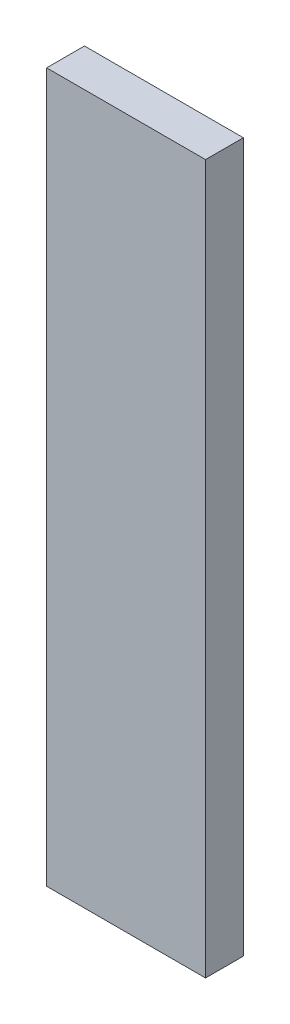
ISO-10303-21;
HEADER;
FILE_DESCRIPTION(('STEP AP214'),'2;1');
FILE_NAME('part.step','',(''),(''),'','','');
FILE_SCHEMA(('AUTOMOTIVE_DESIGN { 1 0 10303 214 1 1 1 1 }'));
ENDSEC;
DATA;
#1=APPLICATION_CONTEXT('core data for automotive mechanical design processes');
#2=APPLICATION_PROTOCOL_DEFINITION('international standard','automotive_design',2000,#1);
#3=PRODUCT_CONTEXT('',#1,'mechanical');
#4=PRODUCT('Part','Part','',(#3));
#5=PRODUCT_RELATED_PRODUCT_CATEGORY('part','',(#4));
#6=PRODUCT_DEFINITION_FORMATION('','',#4);
#7=PRODUCT_DEFINITION_CONTEXT('part definition',#1,'design');
#8=PRODUCT_DEFINITION('design','',#6,#7);
#9=PRODUCT_DEFINITION_SHAPE('','',#8);
#10=(LENGTH_UNIT() NAMED_UNIT(*) SI_UNIT(.MILLI.,.METRE.));
#11=(NAMED_UNIT(*) PLANE_ANGLE_UNIT() SI_UNIT($,.RADIAN.));
#12=(NAMED_UNIT(*) SI_UNIT($,.STERADIAN.) SOLID_ANGLE_UNIT());
#13=UNCERTAINTY_MEASURE_WITH_UNIT(LENGTH_MEASURE(1.E-05),#10,'distance_accuracy_value','');
#14=(GEOMETRIC_REPRESENTATION_CONTEXT(3) GLOBAL_UNCERTAINTY_ASSIGNED_CONTEXT((#13)) GLOBAL_UNIT_ASSIGNED_CONTEXT((#10,
#11,#12)) REPRESENTATION_CONTEXT('',''));
#15=CARTESIAN_POINT('',(0.,0.,0.));
#16=DIRECTION('',(0.,0.,1.));
#17=DIRECTION('',(1.,0.,0.));
#18=AXIS2_PLACEMENT_3D('',#15,#16,#17);
#19=CARTESIAN_POINT('',(-157.5,702.5,-75.));
#20=DIRECTION('',(-1.,0.,0.));
#21=DIRECTION('',(0.,-1.,0.));
#22=AXIS2_PLACEMENT_3D('',#19,#20,#21);
#23=PLANE('',#22);
#24=DIRECTION('',(0.,-1.,0.));
#25=VECTOR('',#24,1.);
#26=CARTESIAN_POINT('',(-157.5,702.5,0.));
#27=LINE('',#26,#25);
#28=CARTESIAN_POINT('',(-157.5,702.5,0.));
#29=VERTEX_POINT('',#28);
#30=CARTESIAN_POINT('',(-157.5,-702.5,0.));
#31=VERTEX_POINT('',#30);
#32=EDGE_CURVE('E100',#29,#31,#27,.T.);
#33=ORIENTED_EDGE('',*,*,#32,.F.);
#34=DIRECTION('',(0.,0.,1.));
#35=VECTOR('',#34,1.);
#36=CARTESIAN_POINT('',(-157.5,702.5,-75.));
#37=LINE('',#36,#35);
#38=CARTESIAN_POINT('',(-157.5,702.5,-75.));
#39=VERTEX_POINT('',#38);
#40=EDGE_CURVE('E11',#39,#29,#37,.T.);
#41=ORIENTED_EDGE('',*,*,#40,.F.);
#42=DIRECTION('',(0.,-1.,0.));
#43=VECTOR('',#42,1.);
#44=CARTESIAN_POINT('',(-157.5,702.5,-75.));
#45=LINE('',#44,#43);
#46=CARTESIAN_POINT('',(-157.5,-702.5,-75.));
#47=VERTEX_POINT('',#46);
#48=EDGE_CURVE('E94',#39,#47,#45,.T.);
#49=ORIENTED_EDGE('',*,*,#48,.T.);
#50=DIRECTION('',(0.,0.,1.));
#51=VECTOR('',#50,1.);
#52=CARTESIAN_POINT('',(-157.5,-702.5,-75.));
#53=LINE('',#52,#51);
#54=EDGE_CURVE('E39',#47,#31,#53,.T.);
#55=ORIENTED_EDGE('',*,*,#54,.T.);
#56=EDGE_LOOP('',(#33,#41,#49,#55));
#57=FACE_BOUND('',#56,.T.);
#58=ADVANCED_FACE('F36',(#57),#23,.T.);
#59=CARTESIAN_POINT('',(157.5,702.5,-75.));
#60=DIRECTION('',(0.,1.,0.));
#61=DIRECTION('',(0.,0.,1.));
#62=AXIS2_PLACEMENT_3D('',#59,#60,#61);
#63=PLANE('',#62);
#64=DIRECTION('',(-1.,0.,0.));
#65=VECTOR('',#64,1.);
#66=CARTESIAN_POINT('',(157.5,702.5,0.));
#67=LINE('',#66,#65);
#68=CARTESIAN_POINT('',(157.5,702.5,0.));
#69=VERTEX_POINT('',#68);
#70=EDGE_CURVE('E96',#69,#29,#67,.T.);
#71=ORIENTED_EDGE('',*,*,#70,.F.);
#72=DIRECTION('',(0.,0.,1.));
#73=VECTOR('',#72,1.);
#74=CARTESIAN_POINT('',(157.5,702.5,-75.));
#75=LINE('',#74,#73);
#76=CARTESIAN_POINT('',(157.5,702.5,-75.));
#77=VERTEX_POINT('',#76);
#78=EDGE_CURVE('E45',#77,#69,#75,.T.);
#79=ORIENTED_EDGE('',*,*,#78,.F.);
#80=DIRECTION('',(-1.,0.,0.));
#81=VECTOR('',#80,1.);
#82=CARTESIAN_POINT('',(157.5,702.5,-75.));
#83=LINE('',#82,#81);
#84=EDGE_CURVE('E91',#77,#39,#83,.T.);
#85=ORIENTED_EDGE('',*,*,#84,.T.);
#86=ORIENTED_EDGE('',*,*,#40,.T.);
#87=EDGE_LOOP('',(#71,#79,#85,#86));
#88=FACE_BOUND('',#87,.T.);
#89=ADVANCED_FACE('F110',(#88),#63,.T.);
#90=CARTESIAN_POINT('',(157.5,702.5,-75.));
#91=DIRECTION('',(1.,0.,0.));
#92=DIRECTION('',(0.,1.,0.));
#93=AXIS2_PLACEMENT_3D('',#90,#91,#92);
#94=PLANE('',#93);
#95=DIRECTION('',(0.,1.,0.));
#96=VECTOR('',#95,1.);
#97=CARTESIAN_POINT('',(157.5,702.5,0.));
#98=LINE('',#97,#96);
#99=CARTESIAN_POINT('',(157.5,-702.5,0.));
#100=VERTEX_POINT('',#99);
#101=EDGE_CURVE('E86',#100,#69,#98,.T.);
#102=ORIENTED_EDGE('',*,*,#101,.F.);
#103=DIRECTION('',(0.,0.,1.));
#104=VECTOR('',#103,1.);
#105=CARTESIAN_POINT('',(157.5,-702.5,-75.));
#106=LINE('',#105,#104);
#107=CARTESIAN_POINT('',(157.5,-702.5,-75.));
#108=VERTEX_POINT('',#107);
#109=EDGE_CURVE('E81',#108,#100,#106,.T.);
#110=ORIENTED_EDGE('',*,*,#109,.F.);
#111=DIRECTION('',(0.,1.,0.));
#112=VECTOR('',#111,1.);
#113=CARTESIAN_POINT('',(157.5,702.5,-75.));
#114=LINE('',#113,#112);
#115=EDGE_CURVE('E84',#108,#77,#114,.T.);
#116=ORIENTED_EDGE('',*,*,#115,.T.);
#117=ORIENTED_EDGE('',*,*,#78,.T.);
#118=EDGE_LOOP('',(#102,#110,#116,#117));
#119=FACE_BOUND('',#118,.T.);
#120=ADVANCED_FACE('F83',(#119),#94,.T.);
#121=CARTESIAN_POINT('',(157.5,-702.5,-75.));
#122=DIRECTION('',(0.,-1.,0.));
#123=DIRECTION('',(0.,0.,-1.));
#124=AXIS2_PLACEMENT_3D('',#121,#122,#123);
#125=PLANE('',#124);
#126=DIRECTION('',(1.,0.,0.));
#127=VECTOR('',#126,1.);
#128=CARTESIAN_POINT('',(157.5,-702.5,0.));
#129=LINE('',#128,#127);
#130=EDGE_CURVE('E103',#31,#100,#129,.T.);
#131=ORIENTED_EDGE('',*,*,#130,.F.);
#132=ORIENTED_EDGE('',*,*,#54,.F.);
#133=DIRECTION('',(1.,0.,0.));
#134=VECTOR('',#133,1.);
#135=CARTESIAN_POINT('',(157.5,-702.5,-75.));
#136=LINE('',#135,#134);
#137=EDGE_CURVE('E90',#47,#108,#136,.T.);
#138=ORIENTED_EDGE('',*,*,#137,.T.);
#139=ORIENTED_EDGE('',*,*,#109,.T.);
#140=EDGE_LOOP('',(#131,#132,#138,#139));
#141=FACE_BOUND('',#140,.T.);
#142=ADVANCED_FACE('F93',(#141),#125,.T.);
#143=CARTESIAN_POINT('',(0.,0.,-75.));
#144=DIRECTION('',(0.,0.,-1.));
#145=DIRECTION('',(-1.,0.,0.));
#146=AXIS2_PLACEMENT_3D('',#143,#144,#145);
#147=PLANE('',#146);
#148=ORIENTED_EDGE('',*,*,#48,.F.);
#149=ORIENTED_EDGE('',*,*,#84,.F.);
#150=ORIENTED_EDGE('',*,*,#115,.F.);
#151=ORIENTED_EDGE('',*,*,#137,.F.);
#152=EDGE_LOOP('',(#148,#149,#150,#151));
#153=FACE_BOUND('',#152,.T.);
#154=ADVANCED_FACE('F89',(#153),#147,.T.);
#155=CARTESIAN_POINT('',(0.,0.,0.));
#156=DIRECTION('',(0.,0.,-1.));
#157=DIRECTION('',(-1.,0.,0.));
#158=AXIS2_PLACEMENT_3D('',#155,#156,#157);
#159=PLANE('',#158);
#160=ORIENTED_EDGE('',*,*,#32,.T.);
#161=ORIENTED_EDGE('',*,*,#130,.T.);
#162=ORIENTED_EDGE('',*,*,#101,.T.);
#163=ORIENTED_EDGE('',*,*,#70,.T.);
#164=EDGE_LOOP('',(#160,#161,#162,#163));
#165=FACE_BOUND('',#164,.T.);
#166=ADVANCED_FACE('F109',(#165),#159,.F.);
#167=CLOSED_SHELL('',(#58,#89,#120,#142,#154,#166));
#168=MANIFOLD_SOLID_BREP('B2',#167);
#169=ADVANCED_BREP_SHAPE_REPRESENTATION('',(#18,#168),#14);
#170=SHAPE_DEFINITION_REPRESENTATION(#9,#169);
ENDSEC;
END-ISO-10303-21;
